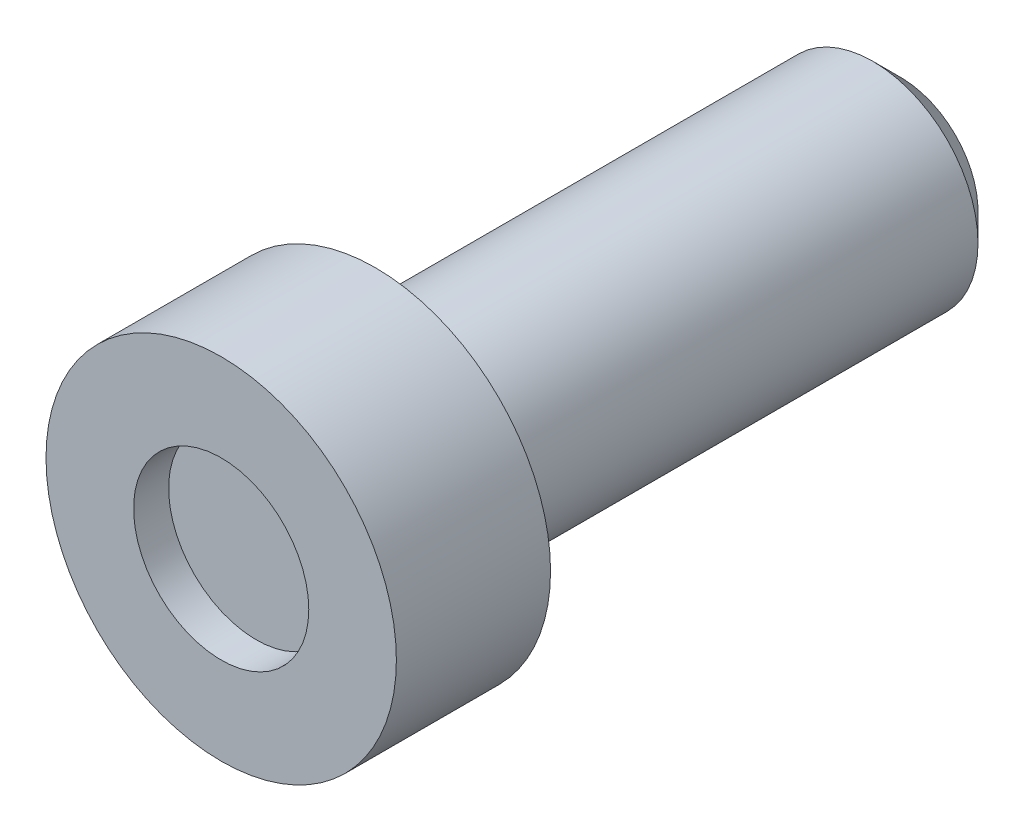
from build123d import *

# Parameters (mm, degrees)
ESQUISSE1_R             = 25
BASE_EXTRUSION_DEPTH    = 22
ESQUISSE2_R             = 12.5
ENL_V_MAT_EXTRU_1_DEPTH = 5
ESQUISSE3_R             = 15
BOSS_EXTRU_1_DEPTH      = 75
CHANFREIN1_SIZE         = 4


with BuildPart() as part:
    # Esquisse1 → Base-Extrusion (new body)
    with BuildSketch(Plane.XY):
        Circle(ESQUISSE1_R)
    extrude(amount=BASE_EXTRUSION_DEPTH)

    # Esquisse2 → Enl_v. mat.-Extru.1 (cut)
    with BuildSketch(Plane.XY.offset(22)):
        Circle(ESQUISSE2_R)
    extrude(amount=-ENL_V_MAT_EXTRU_1_DEPTH, mode=Mode.SUBTRACT)

    # Esquisse3 → Boss.-Extru.1 (add)
    with BuildSketch(Plane(origin=(0, 0, 0), x_dir=(-1, 0, 0), z_dir=(0, 0, -1))):
        with Locations(Location((0, 0, 0), (0, 0, 180))):
            Circle(ESQUISSE3_R)
    extrude(amount=BOSS_EXTRU_1_DEPTH)

    # Chanfrein1
    chanfrein1_edges = [part.edges().sort_by_distance(p)[0] for p in [
        (-15, 0, -75),
    ]]
    chamfer(chanfrein1_edges, length=CHANFREIN1_SIZE)


solid = part.part
